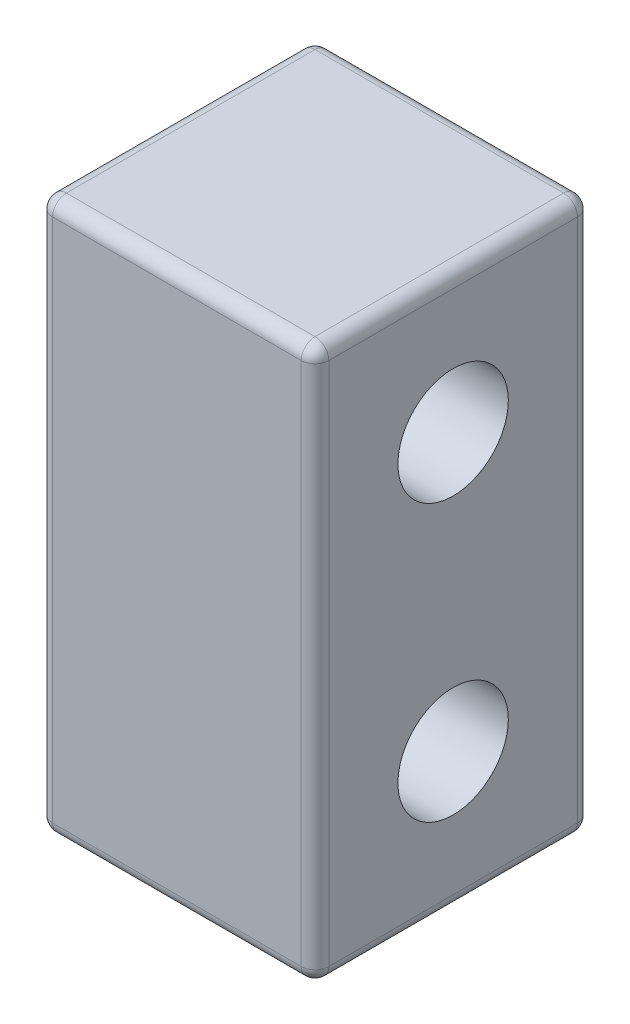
from build123d import *

# Parameters (mm, degrees)
SKETCH1_W          = 50.8
SKETCH1_H          = 101.6
EXTRUDE1_DEPTH     = 50.8
SKETCH2_R          = 10.15068782
CUT_EXTRUDE1_DEPTH = 25.4
FILLET1_R          = 2.54


with BuildPart() as part:
    # Sketch1 → Extrude1 (new body)
    with BuildSketch(Plane(origin=(0, 0, 0), x_dir=(0, 0, -1), z_dir=(1, 0, 0))):
        Rectangle(SKETCH1_W, SKETCH1_H)
    extrude(amount=EXTRUDE1_DEPTH)

    # Sketch2 → Cut-Extrude1 (cut)
    with BuildSketch(Plane(origin=(50.8, 0, 0), x_dir=(0, 0, -1), z_dir=(1, 0, 0))):
        with Locations((0, 25.4)):
            Circle(SKETCH2_R)
        with Locations((0, -25.4)):
            Circle(SKETCH2_R)
    extrude(amount=-CUT_EXTRUDE1_DEPTH, mode=Mode.SUBTRACT)

    # Fillet1
    fillet1_edges = [part.edges().sort_by_distance(p)[0] for p in [
        (50.8, 0, -25.4),
        (50.8, 50.8, 0),
        (50.8, 0, 25.4),
        (0, 50.8, 0),
        (0, 0, -25.4),
        (0, -50.8, 0),
        (0, 0, 25.4),
        (50.8, -50.8, 0),
        (25.4, 50.8, 25.4),
        (25.4, 50.8, -25.4),
        (25.4, -50.8, -25.4),
        (25.4, -50.8, 25.4),
    ]]
    fillet(fillet1_edges, radius=FILLET1_R)


solid = part.part
